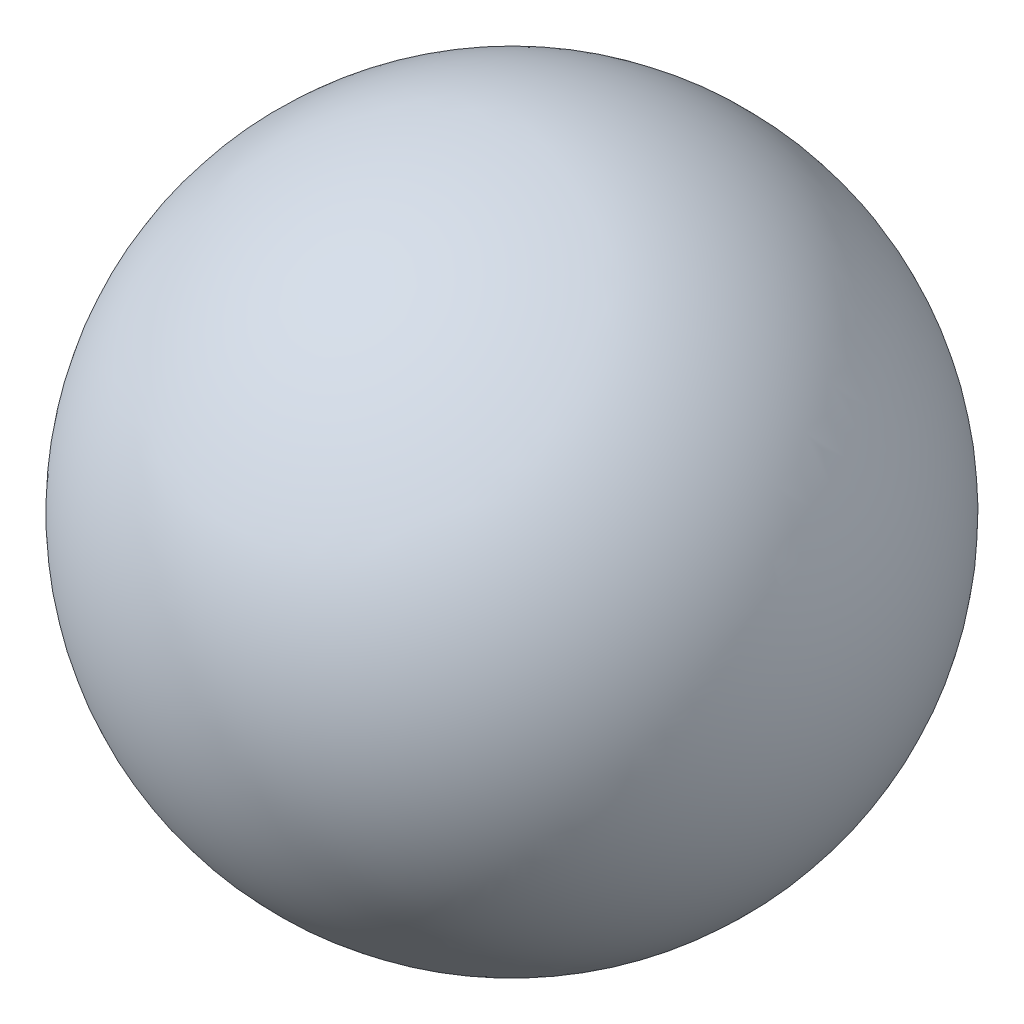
ISO-10303-21;
HEADER;
FILE_DESCRIPTION(('STEP AP214'),'2;1');
FILE_NAME('part.step','',(''),(''),'','','');
FILE_SCHEMA(('AUTOMOTIVE_DESIGN { 1 0 10303 214 1 1 1 1 }'));
ENDSEC;
DATA;
#1=APPLICATION_CONTEXT('core data for automotive mechanical design processes');
#2=APPLICATION_PROTOCOL_DEFINITION('international standard','automotive_design',2000,#1);
#3=PRODUCT_CONTEXT('',#1,'mechanical');
#4=PRODUCT('Part','Part','',(#3));
#5=PRODUCT_RELATED_PRODUCT_CATEGORY('part','',(#4));
#6=PRODUCT_DEFINITION_FORMATION('','',#4);
#7=PRODUCT_DEFINITION_CONTEXT('part definition',#1,'design');
#8=PRODUCT_DEFINITION('design','',#6,#7);
#9=PRODUCT_DEFINITION_SHAPE('','',#8);
#10=(LENGTH_UNIT() NAMED_UNIT(*) SI_UNIT(.MILLI.,.METRE.));
#11=(NAMED_UNIT(*) PLANE_ANGLE_UNIT() SI_UNIT($,.RADIAN.));
#12=(NAMED_UNIT(*) SI_UNIT($,.STERADIAN.) SOLID_ANGLE_UNIT());
#13=UNCERTAINTY_MEASURE_WITH_UNIT(LENGTH_MEASURE(1.E-05),#10,'distance_accuracy_value','');
#14=(GEOMETRIC_REPRESENTATION_CONTEXT(3) GLOBAL_UNCERTAINTY_ASSIGNED_CONTEXT((#13)) GLOBAL_UNIT_ASSIGNED_CONTEXT((#10,
#11,#12)) REPRESENTATION_CONTEXT('',''));
#15=CARTESIAN_POINT('',(0.,0.,0.));
#16=DIRECTION('',(0.,0.,1.));
#17=DIRECTION('',(1.,0.,0.));
#18=AXIS2_PLACEMENT_3D('',#15,#16,#17);
#19=CARTESIAN_POINT('',(4.5,-8.5,0.));
#20=DIRECTION('',(0.736360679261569,0.0599030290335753,0.673932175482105));
#21=DIRECTION('',(0.536733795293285,0.554729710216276,-0.635760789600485));
#22=AXIS2_PLACEMENT_3D('',#19,#20,#21);
#23=SPHERICAL_SURFACE('',#22,2.52);
#24=CARTESIAN_POINT('',(2.64437108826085,-8.65095563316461,-1.69830908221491));
#25=VERTEX_POINT('',#24);
#26=VERTEX_LOOP('',#25);
#27=FACE_BOUND('',#26,.T.);
#28=CARTESIAN_POINT('',(6.35562891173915,-8.34904436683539,1.69830908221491));
#29=VERTEX_POINT('',#28);
#30=VERTEX_LOOP('',#29);
#31=FACE_BOUND('',#30,.T.);
#32=ADVANCED_FACE('F15',(#27,#31),#23,.T.);
#33=CLOSED_SHELL('',(#32));
#34=MANIFOLD_SOLID_BREP('B1',#33);
#35=ADVANCED_BREP_SHAPE_REPRESENTATION('',(#18,#34),#14);
#36=SHAPE_DEFINITION_REPRESENTATION(#9,#35);
ENDSEC;
END-ISO-10303-21;
